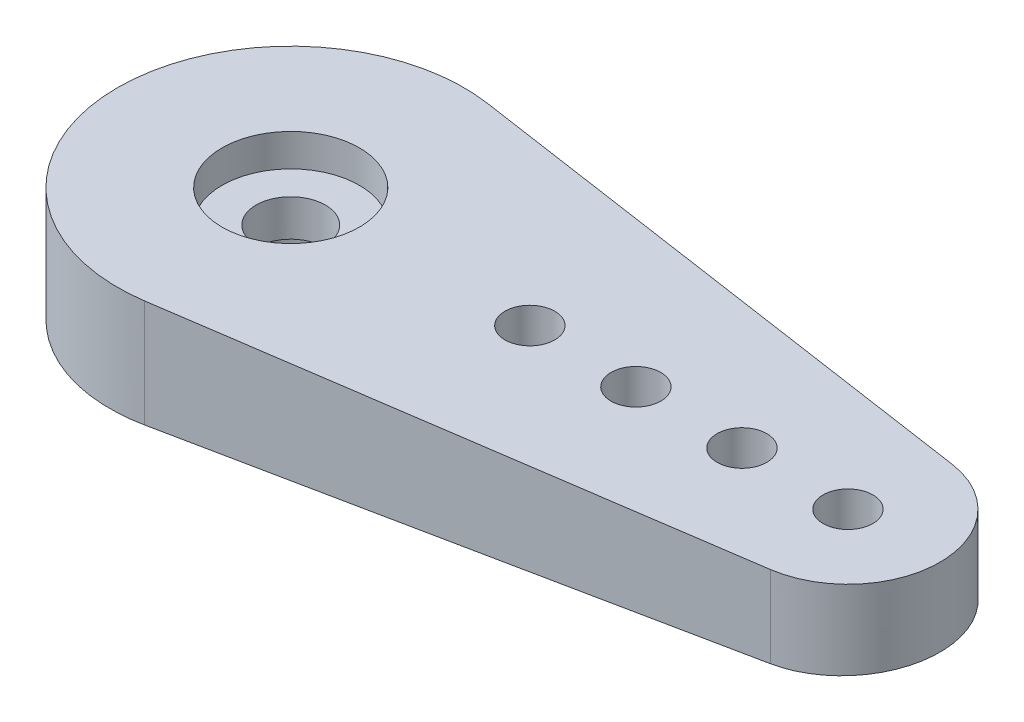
from build123d import *
from build123d.topology import SkipClean

# Parameters (mm, degrees)
ESQUISSE1_R                  = 1.6
ESQUISSE1_R_2                = 1.15
BOSS_EXTRU_1_DEPTH           = 3.5
ESQUISSE4_R                  = 3.175
ENL_V_MAT_EXTRU_3_DEPTH      = 1.5
BOSS_EXTRU_2_START           = 4
BOSS_EXTRU_2_DEPTH           = 4
ENL_V_MAT_EXTRU_4_DEPTH      = 32.304951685
ENL_V_MAT_EXTRU_4_DEPTH_BACK = 32.304951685
ESQUISSE7_R                  = 5.4
BOSS_EXTRU_3_DEPTH           = 3.5
ESQUISSE8_R                  = 3
ENL_V_MAT_EXTRU_5_DEPTH      = 3.8
BOSS_EXTRU_4_REACH           = 33.245


with BuildPart() as part:
    # Esquisse1 → Boss.-Extru.1 (new body)
    with BuildSketch(Plane(origin=(0, 0, 0), x_dir=(1, 0, 0), z_dir=(0, 1, 0))):
        with BuildLine():
            Line((26.368932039, 4.204690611), (1.165048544, 7.914711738))
            ThreePointArc((1.165048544, 7.914711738), (-8, 0), (1.165048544, -7.914711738))
            Line((1.165048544, -7.914711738), (26.368932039, -4.204690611))
            ThreePointArc((26.368932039, -4.204690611), (30, 0), (26.368932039, 4.204690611))
        make_face()
        with Locations(Location((0, 0, 0), (0, 0, 270))):
            Circle(ESQUISSE1_R, mode=Mode.SUBTRACT)
        with Locations(Location((25.75, 0, 0), (0, 0, 270))):
            Circle(ESQUISSE1_R_2, mode=Mode.SUBTRACT)
        with Locations(Location((20.85, 0, 0), (0, 0, 270))):
            Circle(ESQUISSE1_R_2, mode=Mode.SUBTRACT)
        with Locations(Location((15.95, 0, 0), (0, 0, 270))):
            Circle(ESQUISSE1_R_2, mode=Mode.SUBTRACT)
        with Locations(Location((11.05, 0, 0), (0, 0, 270))):
            Circle(ESQUISSE1_R_2, mode=Mode.SUBTRACT)
    extrude(amount=BOSS_EXTRU_1_DEPTH)

    # Esquisse4 → Enl_v. mat.-Extru.3 (cut)
    with BuildSketch(Plane(origin=(0, 3.5, 0), x_dir=(1, 0, 0), z_dir=(0, 1, 0))):
        with Locations(Location((0, 0, 0), (0, 0, 270))):
            Circle(ESQUISSE4_R)
    extrude(amount=-ENL_V_MAT_EXTRU_3_DEPTH, mode=Mode.SUBTRACT)

    # Esquisse5 → Boss.-Extru.2 (add)
    with SkipClean():  # the faces are left unmerged after this step: merging them gives an invalid solid
        with BuildSketch(Plane.XZ.offset(BOSS_EXTRU_2_START)):
            with BuildLine():
                Line((1.165048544, -7.914711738), (26.368932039, -4.204690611))
                ThreePointArc((26.368932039, -4.204690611), (30, 0), (26.368932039, 4.204690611))
                Line((26.368932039, 4.204690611), (1.165048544, 7.914711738))
                ThreePointArc((1.165048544, 7.914711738), (-8, 0), (1.165048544, -7.914711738))
            make_face()
            with BuildLine():
                Line((26.17961165, 2.918549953), (0.975728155, 6.62857108))
                ThreePointArc((0.975728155, 6.62857108), (-6.7, 0), (0.975728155, -6.62857108))
                Line((0.975728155, -6.62857108), (26.17961165, -2.918549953))
                ThreePointArc((26.17961165, -2.918549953), (28.7, 0), (26.17961165, 2.918549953))
            make_face(mode=Mode.SUBTRACT)
        extrude(amount=-BOSS_EXTRU_2_DEPTH)

    # Esquisse6 → Enl_v. mat.-Extru.4 (cut, two sides: drawn at the far end of the back side and taken through both)
    with SkipClean():  # the faces are left unmerged after this step: merging them gives an invalid solid
        with BuildSketch(Plane.XY.offset(-ENL_V_MAT_EXTRU_4_DEPTH_BACK)):
            Polygon((-8, -1.9), (-8, -4), (30, -4), (30, -0.1), align=None)
        extrude(amount=ENL_V_MAT_EXTRU_4_DEPTH + ENL_V_MAT_EXTRU_4_DEPTH_BACK, mode=Mode.SUBTRACT)

    # Esquisse7 → Boss.-Extru.3 (add)
    with SkipClean():  # the faces are left unmerged after this step: merging them gives an invalid solid
        with BuildSketch(Plane.XZ):
            with Locations(Location((0, 0, 0), (0, 0, 90))):
                Circle(ESQUISSE7_R)
        extrude(amount=BOSS_EXTRU_3_DEPTH)

    # Esquisse8 → Enl_v. mat.-Extru.5 (cut)
    with SkipClean():  # the faces are left unmerged after this step: merging them gives an invalid solid
        with BuildSketch(Plane.XZ.offset(3.5)):
            with Locations(Location((0, 0, 0), (0, 0, 270))):
                Circle(ESQUISSE8_R)
        extrude(amount=-ENL_V_MAT_EXTRU_5_DEPTH, mode=Mode.SUBTRACT)

    # Boss.-Extru.4: up to this plane
    with SkipClean():  # the faces are left unmerged after this step: merging them gives an invalid solid
        boss_extru_4_end = Plane(origin=(30, -0.1, -8), z_dir=(-0.047315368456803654, 0.9988800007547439, 0))
        # Esquisse9 → Boss.-Extru.4 (add, up to the surface)
        with BuildSketch(Plane.XZ, mode=Mode.PRIVATE) as boss_extru_4_sk1:
            with BuildLine():
                Line((-0.6, 6.673080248), (-0.6, 5.366563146))
                ThreePointArc((-0.6, 5.366563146), (0, 5.4), (0.6, 5.366563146))
                Line((0.6, 5.366563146), (0.6, 6.673080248))
                ThreePointArc((0.6, 6.673080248), (0, 6.7), (-0.6, 6.673080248))
            make_face()
        boss_extru_4_tool1 = split(extrude(boss_extru_4_sk1.sketch, amount=BOSS_EXTRU_4_REACH, mode=Mode.PRIVATE), bisect_by=boss_extru_4_end, keep=Keep.BOTH, mode=Mode.PRIVATE)
        add(boss_extru_4_tool1.solids().sort_by_distance((0, 0, 6.039938))[0])
        # Esquisse9 → Boss.-Extru.4 (add, up to the surface)
        with BuildSketch(Plane.XZ, mode=Mode.PRIVATE) as boss_extru_4_sk2:
            with BuildLine():
                Line((-5.366563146, 0.6), (-6.673080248, 0.6))
                ThreePointArc((-6.673080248, 0.6), (-6.7, 0), (-6.673080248, -0.6))
                Line((-6.673080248, -0.6), (-5.366563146, -0.6))
                ThreePointArc((-5.366563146, -0.6), (-5.4, 0), (-5.366563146, 0.6))
            make_face()
        boss_extru_4_tool2 = split(extrude(boss_extru_4_sk2.sketch, amount=BOSS_EXTRU_4_REACH, mode=Mode.PRIVATE), bisect_by=boss_extru_4_end, keep=Keep.BOTH, mode=Mode.PRIVATE)
        add(boss_extru_4_tool2.solids().sort_by_distance((-6.039938, 0, 0))[0])
        # Esquisse9 → Boss.-Extru.4 (add, up to the surface)
        with BuildSketch(Plane.XZ, mode=Mode.PRIVATE) as boss_extru_4_sk3:
            with BuildLine():
                Line((-0.6, -5.366563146), (-0.6, -6.673080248))
                ThreePointArc((-0.6, -6.673080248), (0, -6.7), (0.6, -6.673080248))
                Line((0.6, -6.673080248), (0.6, -5.366563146))
                ThreePointArc((0.6, -5.366563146), (0, -5.4), (-0.6, -5.366563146))
            make_face()
        boss_extru_4_tool3 = split(extrude(boss_extru_4_sk3.sketch, amount=BOSS_EXTRU_4_REACH, mode=Mode.PRIVATE), bisect_by=boss_extru_4_end, keep=Keep.BOTH, mode=Mode.PRIVATE)
        add(boss_extru_4_tool3.solids().sort_by_distance((0, 0, -6.039938))[0])


solid = part.part
